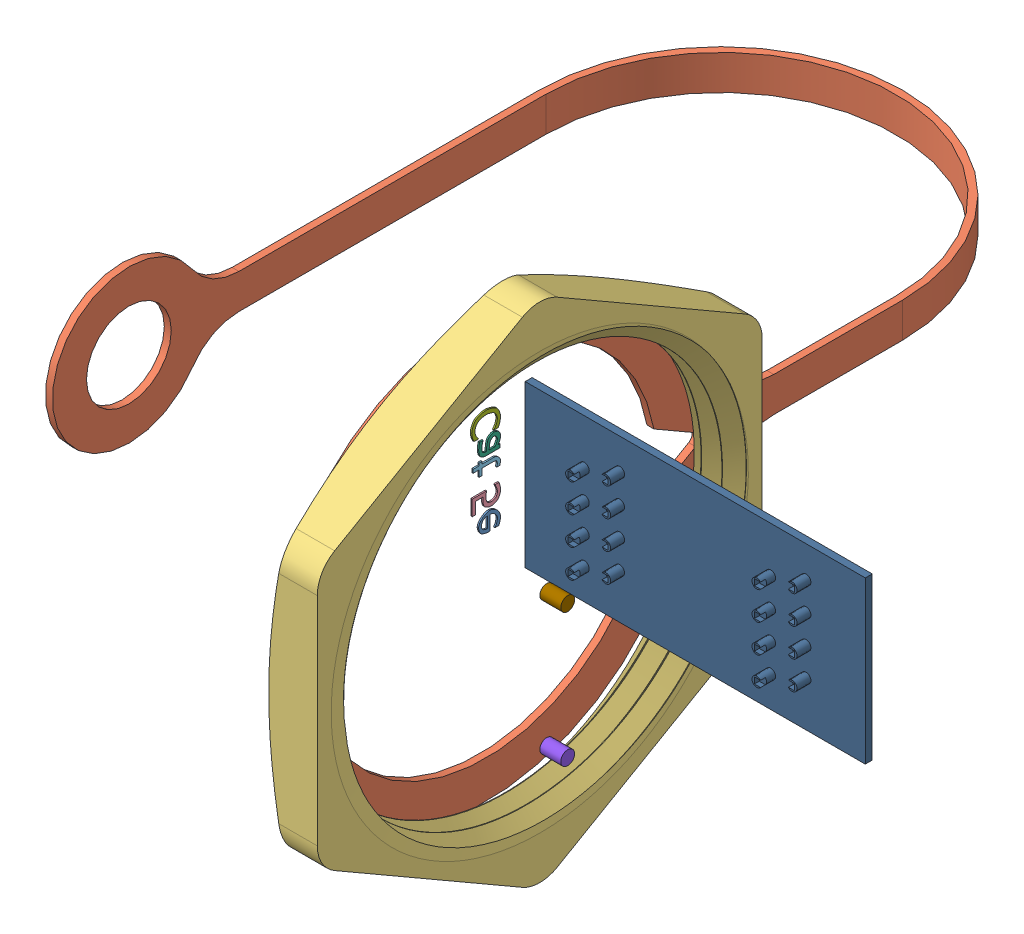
SolidWorks assembly Conec_17K1A184_17-10020_RJ45_Einbaubuchse.SLDASM, configuration Standard (file format 6000). Lengths in mm.
Overall size (46.66 36.19 60.88).
10 component instances, 10 part files, 0 mates.
Components (placement in the parent):
- 17-10000_7-1: 17-10000_7.sldprt [Standard] at origin size (0.1 1.38 1.66)
- 17-10000_9-1: 17-10000_9.sldprt [Standard] at origin size (26.15 30 58.08)
- 17-10000-1: 17-10000.sldprt [Standard] at origin size (4.14 36.19 35.6)
- 17-10000_4-1: 17-10000_4.sldprt [Standard] at origin size (0.1 1.24 2.08)
- 17-10000_11-1: 17-10000_11.sldprt [Standard] at origin size (0.1 0.89 2)
- 17-10000_8-1: 17-10000_8.sldprt [Standard] at origin size (0.1 1.27 1.63)
- 17-10000_2-1: 17-10000_2.sldprt [Standard] at origin size (0.1 1.6 2.19)
- 17-10000_6-1: 17-10000_6.sldprt [Standard] at origin size (1.51 1 1)
- 17-10000_10-1: 17-10000_10.sldprt [Standard] at origin size (1.51 1 1)
- 17-10000_5-1: 17-10000_5.sldprt [Standard] at origin size (24.46 11.6 1.5)
